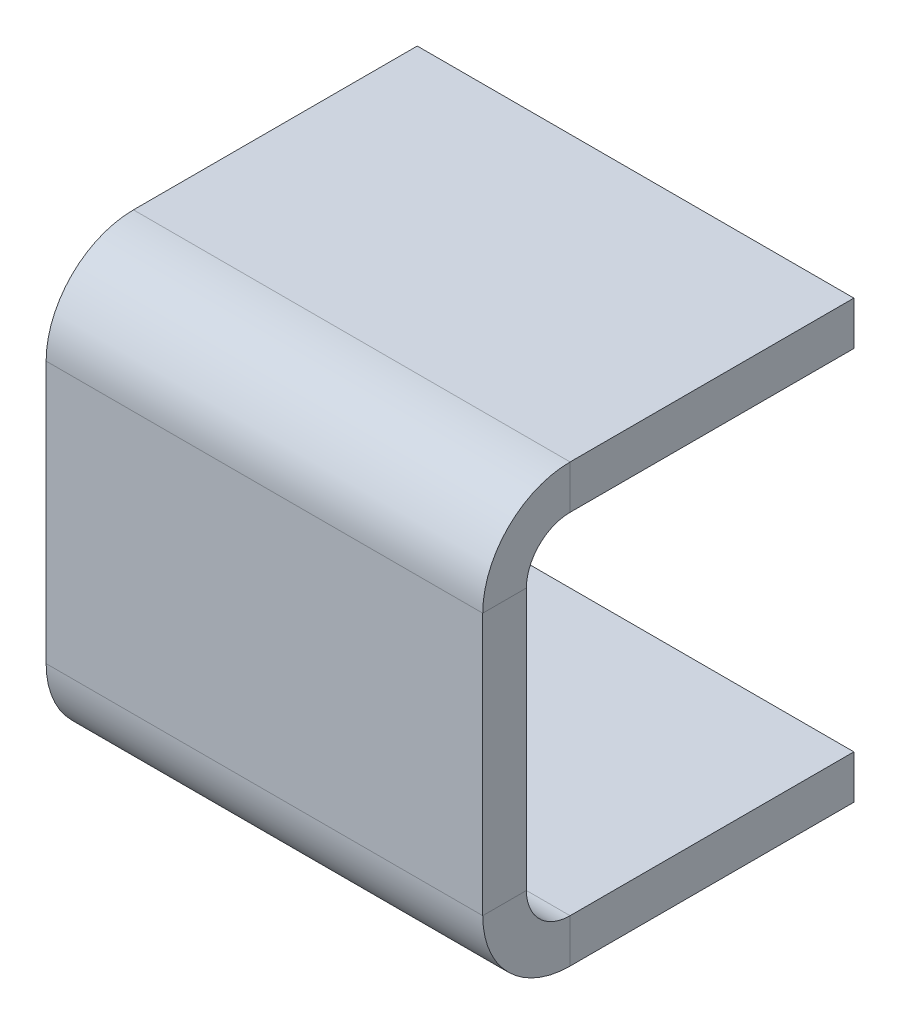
ISO-10303-21;
HEADER;
FILE_DESCRIPTION(('STEP AP214'),'2;1');
FILE_NAME('part.step','',(''),(''),'','','');
FILE_SCHEMA(('AUTOMOTIVE_DESIGN { 1 0 10303 214 1 1 1 1 }'));
ENDSEC;
DATA;
#1=APPLICATION_CONTEXT('core data for automotive mechanical design processes');
#2=APPLICATION_PROTOCOL_DEFINITION('international standard','automotive_design',2000,#1);
#3=PRODUCT_CONTEXT('',#1,'mechanical');
#4=PRODUCT('Part','Part','',(#3));
#5=PRODUCT_RELATED_PRODUCT_CATEGORY('part','',(#4));
#6=PRODUCT_DEFINITION_FORMATION('','',#4);
#7=PRODUCT_DEFINITION_CONTEXT('part definition',#1,'design');
#8=PRODUCT_DEFINITION('design','',#6,#7);
#9=PRODUCT_DEFINITION_SHAPE('','',#8);
#10=(LENGTH_UNIT() NAMED_UNIT(*) SI_UNIT(.MILLI.,.METRE.));
#11=(NAMED_UNIT(*) PLANE_ANGLE_UNIT() SI_UNIT($,.RADIAN.));
#12=(NAMED_UNIT(*) SI_UNIT($,.STERADIAN.) SOLID_ANGLE_UNIT());
#13=UNCERTAINTY_MEASURE_WITH_UNIT(LENGTH_MEASURE(1.E-05),#10,'distance_accuracy_value','');
#14=(GEOMETRIC_REPRESENTATION_CONTEXT(3) GLOBAL_UNCERTAINTY_ASSIGNED_CONTEXT((#13)) GLOBAL_UNIT_ASSIGNED_CONTEXT((#10,
#11,#12)) REPRESENTATION_CONTEXT('',''));
#15=CARTESIAN_POINT('',(0.,0.,0.));
#16=DIRECTION('',(0.,0.,1.));
#17=DIRECTION('',(1.,0.,0.));
#18=AXIS2_PLACEMENT_3D('',#15,#16,#17);
#19=CARTESIAN_POINT('',(0.,18.,17.));
#20=DIRECTION('',(-1.,0.,0.));
#21=DIRECTION('',(0.,-1.,0.));
#22=AXIS2_PLACEMENT_3D('',#19,#20,#21);
#23=PLANE('',#22);
#24=DIRECTION('',(0.,0.,1.));
#25=VECTOR('',#24,1.);
#26=CARTESIAN_POINT('',(0.,16.,15.));
#27=LINE('',#26,#25);
#28=CARTESIAN_POINT('',(0.,16.,15.));
#29=VERTEX_POINT('',#28);
#30=CARTESIAN_POINT('',(0.,16.,17.));
#31=VERTEX_POINT('',#30);
#32=EDGE_CURVE('E176',#29,#31,#27,.T.);
#33=ORIENTED_EDGE('',*,*,#32,.T.);
#34=DIRECTION('',(0.,1.,0.));
#35=VECTOR('',#34,1.);
#36=CARTESIAN_POINT('',(0.,18.,17.));
#37=LINE('',#36,#35);
#38=CARTESIAN_POINT('',(0.,3.99999999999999,17.));
#39=VERTEX_POINT('',#38);
#40=EDGE_CURVE('E197',#39,#31,#37,.T.);
#41=ORIENTED_EDGE('',*,*,#40,.F.);
#42=DIRECTION('',(0.,0.,1.));
#43=VECTOR('',#42,1.);
#44=CARTESIAN_POINT('',(0.,3.99999999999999,15.));
#45=LINE('',#44,#43);
#46=CARTESIAN_POINT('',(0.,3.99999999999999,15.));
#47=VERTEX_POINT('',#46);
#48=EDGE_CURVE('E184',#47,#39,#45,.T.);
#49=ORIENTED_EDGE('',*,*,#48,.F.);
#50=DIRECTION('',(0.,1.,0.));
#51=VECTOR('',#50,1.);
#52=CARTESIAN_POINT('',(0.,18.,15.));
#53=LINE('',#52,#51);
#54=EDGE_CURVE('E192',#47,#29,#53,.T.);
#55=ORIENTED_EDGE('',*,*,#54,.T.);
#56=EDGE_LOOP('',(#33,#41,#49,#55));
#57=FACE_BOUND('',#56,.T.);
#58=ADVANCED_FACE('F33',(#57),#23,.F.);
#59=CARTESIAN_POINT('',(-20.,2.,17.));
#60=DIRECTION('',(1.,0.,0.));
#61=DIRECTION('',(0.,0.,-1.));
#62=AXIS2_PLACEMENT_3D('',#59,#60,#61);
#63=PLANE('',#62);
#64=DIRECTION('',(0.,0.,1.));
#65=VECTOR('',#64,1.);
#66=CARTESIAN_POINT('',(-20.,16.,15.));
#67=LINE('',#66,#65);
#68=CARTESIAN_POINT('',(-20.,16.,15.));
#69=VERTEX_POINT('',#68);
#70=CARTESIAN_POINT('',(-20.,16.,17.));
#71=VERTEX_POINT('',#70);
#72=EDGE_CURVE('E178',#69,#71,#67,.T.);
#73=ORIENTED_EDGE('',*,*,#72,.F.);
#74=DIRECTION('',(0.,-1.,0.));
#75=VECTOR('',#74,1.);
#76=CARTESIAN_POINT('',(-20.,2.,15.));
#77=LINE('',#76,#75);
#78=CARTESIAN_POINT('',(-20.,3.99999999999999,15.));
#79=VERTEX_POINT('',#78);
#80=EDGE_CURVE('E195',#69,#79,#77,.T.);
#81=ORIENTED_EDGE('',*,*,#80,.T.);
#82=DIRECTION('',(0.,0.,1.));
#83=VECTOR('',#82,1.);
#84=CARTESIAN_POINT('',(-20.,3.99999999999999,15.));
#85=LINE('',#84,#83);
#86=CARTESIAN_POINT('',(-20.,3.99999999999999,17.));
#87=VERTEX_POINT('',#86);
#88=EDGE_CURVE('E180',#79,#87,#85,.T.);
#89=ORIENTED_EDGE('',*,*,#88,.T.);
#90=DIRECTION('',(0.,-1.,0.));
#91=VECTOR('',#90,1.);
#92=CARTESIAN_POINT('',(-20.,2.,17.));
#93=LINE('',#92,#91);
#94=EDGE_CURVE('E200',#71,#87,#93,.T.);
#95=ORIENTED_EDGE('',*,*,#94,.F.);
#96=EDGE_LOOP('',(#73,#81,#89,#95));
#97=FACE_BOUND('',#96,.T.);
#98=ADVANCED_FACE('F272',(#97),#63,.F.);
#99=CARTESIAN_POINT('',(0.,18.,17.));
#100=DIRECTION('',(0.,0.,1.));
#101=DIRECTION('',(1.,0.,0.));
#102=AXIS2_PLACEMENT_3D('',#99,#100,#101);
#103=PLANE('',#102);
#104=ORIENTED_EDGE('',*,*,#40,.T.);
#105=DIRECTION('',(1.,0.,0.));
#106=VECTOR('',#105,1.);
#107=CARTESIAN_POINT('',(0.,16.,17.));
#108=LINE('',#107,#106);
#109=EDGE_CURVE('E127',#31,#71,#108,.F.);
#110=ORIENTED_EDGE('',*,*,#109,.T.);
#111=ORIENTED_EDGE('',*,*,#94,.T.);
#112=DIRECTION('',(1.,0.,0.));
#113=VECTOR('',#112,1.);
#114=CARTESIAN_POINT('',(0.,3.99999999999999,17.));
#115=LINE('',#114,#113);
#116=EDGE_CURVE('E187',#87,#39,#115,.T.);
#117=ORIENTED_EDGE('',*,*,#116,.T.);
#118=EDGE_LOOP('',(#104,#110,#111,#117));
#119=FACE_BOUND('',#118,.T.);
#120=ADVANCED_FACE('F268',(#119),#103,.T.);
#121=CARTESIAN_POINT('',(0.,18.,15.));
#122=DIRECTION('',(0.,0.,1.));
#123=DIRECTION('',(1.,0.,0.));
#124=AXIS2_PLACEMENT_3D('',#121,#122,#123);
#125=PLANE('',#124);
#126=DIRECTION('',(1.,0.,0.));
#127=VECTOR('',#126,1.);
#128=CARTESIAN_POINT('',(0.,16.,15.));
#129=LINE('',#128,#127);
#130=EDGE_CURVE('E172',#29,#69,#129,.F.);
#131=ORIENTED_EDGE('',*,*,#130,.F.);
#132=ORIENTED_EDGE('',*,*,#54,.F.);
#133=DIRECTION('',(1.,0.,0.));
#134=VECTOR('',#133,1.);
#135=CARTESIAN_POINT('',(-20.,3.99999999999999,15.));
#136=LINE('',#135,#134);
#137=EDGE_CURVE('E182',#79,#47,#136,.T.);
#138=ORIENTED_EDGE('',*,*,#137,.F.);
#139=ORIENTED_EDGE('',*,*,#80,.F.);
#140=EDGE_LOOP('',(#131,#132,#138,#139));
#141=FACE_BOUND('',#140,.T.);
#142=ADVANCED_FACE('F262',(#141),#125,.F.);
#143=CARTESIAN_POINT('',(0.,2.,15.));
#144=DIRECTION('',(0.,-1.,0.));
#145=DIRECTION('',(1.,0.,0.));
#146=AXIS2_PLACEMENT_3D('',#143,#144,#145);
#147=PLANE('',#146);
#148=DIRECTION('',(1.,0.,0.));
#149=VECTOR('',#148,1.);
#150=CARTESIAN_POINT('',(0.,2.,13.));
#151=LINE('',#150,#149);
#152=CARTESIAN_POINT('',(0.,2.,13.));
#153=VERTEX_POINT('',#152);
#154=CARTESIAN_POINT('',(-20.,2.,13.));
#155=VERTEX_POINT('',#154);
#156=EDGE_CURVE('E207',#153,#155,#151,.F.);
#157=ORIENTED_EDGE('',*,*,#156,.F.);
#158=DIRECTION('',(0.,0.,-1.));
#159=VECTOR('',#158,1.);
#160=CARTESIAN_POINT('',(0.,2.,15.));
#161=LINE('',#160,#159);
#162=CARTESIAN_POINT('',(0.,2.,0.));
#163=VERTEX_POINT('',#162);
#164=EDGE_CURVE('E56',#153,#163,#161,.T.);
#165=ORIENTED_EDGE('',*,*,#164,.T.);
#166=DIRECTION('',(-1.,0.,0.));
#167=VECTOR('',#166,1.);
#168=CARTESIAN_POINT('',(0.,2.,0.));
#169=LINE('',#168,#167);
#170=CARTESIAN_POINT('',(-20.,2.,0.));
#171=VERTEX_POINT('',#170);
#172=EDGE_CURVE('E223',#163,#171,#169,.T.);
#173=ORIENTED_EDGE('',*,*,#172,.T.);
#174=DIRECTION('',(0.,0.,-1.));
#175=VECTOR('',#174,1.);
#176=CARTESIAN_POINT('',(-20.,2.,15.));
#177=LINE('',#176,#175);
#178=EDGE_CURVE('E11',#155,#171,#177,.T.);
#179=ORIENTED_EDGE('',*,*,#178,.F.);
#180=EDGE_LOOP('',(#157,#165,#173,#179));
#181=FACE_BOUND('',#180,.T.);
#182=ADVANCED_FACE('F35',(#181),#147,.F.);
#183=CARTESIAN_POINT('',(0.,0.,15.));
#184=DIRECTION('',(0.,-1.,0.));
#185=DIRECTION('',(1.,0.,0.));
#186=AXIS2_PLACEMENT_3D('',#183,#184,#185);
#187=PLANE('',#186);
#188=DIRECTION('',(0.,0.,-1.));
#189=VECTOR('',#188,1.);
#190=CARTESIAN_POINT('',(0.,0.,15.));
#191=LINE('',#190,#189);
#192=CARTESIAN_POINT('',(0.,0.,13.));
#193=VERTEX_POINT('',#192);
#194=CARTESIAN_POINT('',(0.,0.,0.));
#195=VERTEX_POINT('',#194);
#196=EDGE_CURVE('E237',#193,#195,#191,.T.);
#197=ORIENTED_EDGE('',*,*,#196,.F.);
#198=DIRECTION('',(1.,0.,0.));
#199=VECTOR('',#198,1.);
#200=CARTESIAN_POINT('',(0.,0.,13.));
#201=LINE('',#200,#199);
#202=CARTESIAN_POINT('',(-20.,0.,13.));
#203=VERTEX_POINT('',#202);
#204=EDGE_CURVE('E211',#193,#203,#201,.F.);
#205=ORIENTED_EDGE('',*,*,#204,.T.);
#206=DIRECTION('',(0.,0.,-1.));
#207=VECTOR('',#206,1.);
#208=CARTESIAN_POINT('',(-20.,0.,15.));
#209=LINE('',#208,#207);
#210=CARTESIAN_POINT('',(-20.,0.,0.));
#211=VERTEX_POINT('',#210);
#212=EDGE_CURVE('E41',#203,#211,#209,.T.);
#213=ORIENTED_EDGE('',*,*,#212,.T.);
#214=DIRECTION('',(-1.,0.,0.));
#215=VECTOR('',#214,1.);
#216=CARTESIAN_POINT('',(0.,0.,0.));
#217=LINE('',#216,#215);
#218=EDGE_CURVE('E230',#195,#211,#217,.T.);
#219=ORIENTED_EDGE('',*,*,#218,.F.);
#220=EDGE_LOOP('',(#197,#205,#213,#219));
#221=FACE_BOUND('',#220,.T.);
#222=ADVANCED_FACE('F243',(#221),#187,.T.);
#223=CARTESIAN_POINT('',(0.,2.,15.));
#224=DIRECTION('',(1.,0.,0.));
#225=DIRECTION('',(0.,1.,0.));
#226=AXIS2_PLACEMENT_3D('',#223,#224,#225);
#227=PLANE('',#226);
#228=ORIENTED_EDGE('',*,*,#164,.F.);
#229=DIRECTION('',(0.,-1.,0.));
#230=VECTOR('',#229,1.);
#231=CARTESIAN_POINT('',(0.,2.,13.));
#232=LINE('',#231,#230);
#233=EDGE_CURVE('E217',#153,#193,#232,.T.);
#234=ORIENTED_EDGE('',*,*,#233,.T.);
#235=ORIENTED_EDGE('',*,*,#196,.T.);
#236=DIRECTION('',(0.,-1.,0.));
#237=VECTOR('',#236,1.);
#238=CARTESIAN_POINT('',(0.,2.,0.));
#239=LINE('',#238,#237);
#240=EDGE_CURVE('E233',#163,#195,#239,.T.);
#241=ORIENTED_EDGE('',*,*,#240,.F.);
#242=EDGE_LOOP('',(#228,#234,#235,#241));
#243=FACE_BOUND('',#242,.T.);
#244=ADVANCED_FACE('F252',(#243),#227,.T.);
#245=CARTESIAN_POINT('',(-20.,0.,15.));
#246=DIRECTION('',(-1.,0.,0.));
#247=DIRECTION('',(0.,0.,1.));
#248=AXIS2_PLACEMENT_3D('',#245,#246,#247);
#249=PLANE('',#248);
#250=DIRECTION('',(0.,-1.,0.));
#251=VECTOR('',#250,1.);
#252=CARTESIAN_POINT('',(-20.,2.,13.));
#253=LINE('',#252,#251);
#254=EDGE_CURVE('E220',#155,#203,#253,.T.);
#255=ORIENTED_EDGE('',*,*,#254,.F.);
#256=ORIENTED_EDGE('',*,*,#178,.T.);
#257=DIRECTION('',(0.,1.,0.));
#258=VECTOR('',#257,1.);
#259=CARTESIAN_POINT('',(-20.,0.,0.));
#260=LINE('',#259,#258);
#261=EDGE_CURVE('E227',#211,#171,#260,.T.);
#262=ORIENTED_EDGE('',*,*,#261,.F.);
#263=ORIENTED_EDGE('',*,*,#212,.F.);
#264=EDGE_LOOP('',(#255,#256,#262,#263));
#265=FACE_BOUND('',#264,.T.);
#266=ADVANCED_FACE('F246',(#265),#249,.T.);
#267=CARTESIAN_POINT('',(0.,2.,0.));
#268=DIRECTION('',(0.,0.,1.));
#269=DIRECTION('',(1.,0.,0.));
#270=AXIS2_PLACEMENT_3D('',#267,#268,#269);
#271=PLANE('',#270);
#272=ORIENTED_EDGE('',*,*,#172,.F.);
#273=ORIENTED_EDGE('',*,*,#240,.T.);
#274=ORIENTED_EDGE('',*,*,#218,.T.);
#275=ORIENTED_EDGE('',*,*,#261,.T.);
#276=EDGE_LOOP('',(#272,#273,#274,#275));
#277=FACE_BOUND('',#276,.T.);
#278=ADVANCED_FACE('F249',(#277),#271,.F.);
#279=CARTESIAN_POINT('',(-20.,3.99999999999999,13.));
#280=DIRECTION('',(-1.,0.,0.));
#281=DIRECTION('',(0.,0.,1.));
#282=AXIS2_PLACEMENT_3D('',#279,#280,#281);
#283=PLANE('',#282);
#284=ORIENTED_EDGE('',*,*,#88,.F.);
#285=CARTESIAN_POINT('',(-20.,3.99999999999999,13.));
#286=DIRECTION('',(1.,0.,0.));
#287=DIRECTION('',(0.,0.,-1.));
#288=AXIS2_PLACEMENT_3D('',#285,#286,#287);
#289=CIRCLE('',#288,2.);
#290=EDGE_CURVE('E203',#155,#79,#289,.F.);
#291=ORIENTED_EDGE('',*,*,#290,.F.);
#292=ORIENTED_EDGE('',*,*,#254,.T.);
#293=CARTESIAN_POINT('',(-20.,3.99999999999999,13.));
#294=DIRECTION('',(1.,0.,0.));
#295=DIRECTION('',(0.,0.,-1.));
#296=AXIS2_PLACEMENT_3D('',#293,#294,#295);
#297=CIRCLE('',#296,4.);
#298=EDGE_CURVE('E214',#203,#87,#297,.F.);
#299=ORIENTED_EDGE('',*,*,#298,.T.);
#300=EDGE_LOOP('',(#284,#291,#292,#299));
#301=FACE_BOUND('',#300,.T.);
#302=ADVANCED_FACE('F289',(#301),#283,.T.);
#303=CARTESIAN_POINT('',(0.,3.99999999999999,13.));
#304=DIRECTION('',(-1.,0.,0.));
#305=DIRECTION('',(0.,0.,1.));
#306=AXIS2_PLACEMENT_3D('',#303,#304,#305);
#307=PLANE('',#306);
#308=CARTESIAN_POINT('',(0.,3.99999999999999,13.));
#309=DIRECTION('',(1.,0.,0.));
#310=DIRECTION('',(0.,0.,-1.));
#311=AXIS2_PLACEMENT_3D('',#308,#309,#310);
#312=CIRCLE('',#311,2.);
#313=EDGE_CURVE('E202',#47,#153,#312,.T.);
#314=ORIENTED_EDGE('',*,*,#313,.F.);
#315=ORIENTED_EDGE('',*,*,#48,.T.);
#316=CARTESIAN_POINT('',(0.,3.99999999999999,13.));
#317=DIRECTION('',(1.,0.,0.));
#318=DIRECTION('',(0.,0.,-1.));
#319=AXIS2_PLACEMENT_3D('',#316,#317,#318);
#320=CIRCLE('',#319,4.);
#321=EDGE_CURVE('E206',#39,#193,#320,.T.);
#322=ORIENTED_EDGE('',*,*,#321,.T.);
#323=ORIENTED_EDGE('',*,*,#233,.F.);
#324=EDGE_LOOP('',(#314,#315,#322,#323));
#325=FACE_BOUND('',#324,.T.);
#326=ADVANCED_FACE('F255',(#325),#307,.F.);
#327=CARTESIAN_POINT('',(0.,3.99999999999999,13.));
#328=DIRECTION('',(1.,0.,0.));
#329=DIRECTION('',(0.,0.,1.));
#330=AXIS2_PLACEMENT_3D('',#327,#328,#329);
#331=CYLINDRICAL_SURFACE('',#330,4.);
#332=ORIENTED_EDGE('',*,*,#204,.F.);
#333=ORIENTED_EDGE('',*,*,#321,.F.);
#334=ORIENTED_EDGE('',*,*,#116,.F.);
#335=ORIENTED_EDGE('',*,*,#298,.F.);
#336=EDGE_LOOP('',(#332,#333,#334,#335));
#337=FACE_BOUND('',#336,.T.);
#338=ADVANCED_FACE('F285',(#337),#331,.T.);
#339=CARTESIAN_POINT('',(0.,3.99999999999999,13.));
#340=DIRECTION('',(1.,0.,0.));
#341=DIRECTION('',(0.,0.,1.));
#342=AXIS2_PLACEMENT_3D('',#339,#340,#341);
#343=CYLINDRICAL_SURFACE('',#342,2.);
#344=ORIENTED_EDGE('',*,*,#156,.T.);
#345=ORIENTED_EDGE('',*,*,#290,.T.);
#346=ORIENTED_EDGE('',*,*,#137,.T.);
#347=ORIENTED_EDGE('',*,*,#313,.T.);
#348=EDGE_LOOP('',(#344,#345,#346,#347));
#349=FACE_BOUND('',#348,.T.);
#350=ADVANCED_FACE('F258',(#349),#343,.F.);
#351=CARTESIAN_POINT('',(-20.,16.,13.));
#352=DIRECTION('',(-1.,0.,0.));
#353=DIRECTION('',(0.,0.,1.));
#354=AXIS2_PLACEMENT_3D('',#351,#352,#353);
#355=PLANE('',#354);
#356=DIRECTION('',(0.,1.,0.));
#357=VECTOR('',#356,1.);
#358=CARTESIAN_POINT('',(-20.,18.,13.));
#359=LINE('',#358,#357);
#360=CARTESIAN_POINT('',(-20.,18.,13.));
#361=VERTEX_POINT('',#360);
#362=CARTESIAN_POINT('',(-20.,20.,13.));
#363=VERTEX_POINT('',#362);
#364=EDGE_CURVE('E511',#361,#363,#359,.T.);
#365=ORIENTED_EDGE('',*,*,#364,.F.);
#366=CARTESIAN_POINT('',(-20.,16.,13.));
#367=DIRECTION('',(1.,0.,0.));
#368=DIRECTION('',(0.,0.,-1.));
#369=AXIS2_PLACEMENT_3D('',#366,#367,#368);
#370=CIRCLE('',#369,2.);
#371=EDGE_CURVE('E130',#69,#361,#370,.F.);
#372=ORIENTED_EDGE('',*,*,#371,.F.);
#373=ORIENTED_EDGE('',*,*,#72,.T.);
#374=CARTESIAN_POINT('',(-20.,16.,13.));
#375=DIRECTION('',(1.,0.,0.));
#376=DIRECTION('',(0.,0.,-1.));
#377=AXIS2_PLACEMENT_3D('',#374,#375,#376);
#378=CIRCLE('',#377,4.);
#379=EDGE_CURVE('E48',#71,#363,#378,.F.);
#380=ORIENTED_EDGE('',*,*,#379,.T.);
#381=EDGE_LOOP('',(#365,#372,#373,#380));
#382=FACE_BOUND('',#381,.T.);
#383=ADVANCED_FACE('F284',(#382),#355,.T.);
#384=CARTESIAN_POINT('',(0.,16.,13.));
#385=DIRECTION('',(-1.,0.,0.));
#386=DIRECTION('',(0.,0.,1.));
#387=AXIS2_PLACEMENT_3D('',#384,#385,#386);
#388=PLANE('',#387);
#389=CARTESIAN_POINT('',(0.,16.,13.));
#390=DIRECTION('',(1.,0.,0.));
#391=DIRECTION('',(0.,0.,-1.));
#392=AXIS2_PLACEMENT_3D('',#389,#390,#391);
#393=CIRCLE('',#392,2.);
#394=CARTESIAN_POINT('',(0.,18.,13.));
#395=VERTEX_POINT('',#394);
#396=EDGE_CURVE('E137',#395,#29,#393,.T.);
#397=ORIENTED_EDGE('',*,*,#396,.F.);
#398=DIRECTION('',(0.,1.,0.));
#399=VECTOR('',#398,1.);
#400=CARTESIAN_POINT('',(0.,18.,13.));
#401=LINE('',#400,#399);
#402=CARTESIAN_POINT('',(0.,20.,13.));
#403=VERTEX_POINT('',#402);
#404=EDGE_CURVE('E134',#395,#403,#401,.T.);
#405=ORIENTED_EDGE('',*,*,#404,.T.);
#406=CARTESIAN_POINT('',(0.,16.,13.));
#407=DIRECTION('',(1.,0.,0.));
#408=DIRECTION('',(0.,0.,-1.));
#409=AXIS2_PLACEMENT_3D('',#406,#407,#408);
#410=CIRCLE('',#409,4.);
#411=EDGE_CURVE('E121',#403,#31,#410,.T.);
#412=ORIENTED_EDGE('',*,*,#411,.T.);
#413=ORIENTED_EDGE('',*,*,#32,.F.);
#414=EDGE_LOOP('',(#397,#405,#412,#413));
#415=FACE_BOUND('',#414,.T.);
#416=ADVANCED_FACE('F135',(#415),#388,.F.);
#417=CARTESIAN_POINT('',(0.,16.,13.));
#418=DIRECTION('',(1.,0.,0.));
#419=DIRECTION('',(0.,1.,0.));
#420=AXIS2_PLACEMENT_3D('',#417,#418,#419);
#421=CYLINDRICAL_SURFACE('',#420,4.);
#422=ORIENTED_EDGE('',*,*,#109,.F.);
#423=ORIENTED_EDGE('',*,*,#411,.F.);
#424=DIRECTION('',(-1.,0.,0.));
#425=VECTOR('',#424,1.);
#426=CARTESIAN_POINT('',(-20.,20.,13.));
#427=LINE('',#426,#425);
#428=EDGE_CURVE('E125',#403,#363,#427,.T.);
#429=ORIENTED_EDGE('',*,*,#428,.T.);
#430=ORIENTED_EDGE('',*,*,#379,.F.);
#431=EDGE_LOOP('',(#422,#423,#429,#430));
#432=FACE_BOUND('',#431,.T.);
#433=ADVANCED_FACE('F123',(#432),#421,.T.);
#434=CARTESIAN_POINT('',(0.,16.,13.));
#435=DIRECTION('',(1.,0.,0.));
#436=DIRECTION('',(0.,1.,0.));
#437=AXIS2_PLACEMENT_3D('',#434,#435,#436);
#438=CYLINDRICAL_SURFACE('',#437,2.);
#439=ORIENTED_EDGE('',*,*,#130,.T.);
#440=ORIENTED_EDGE('',*,*,#371,.T.);
#441=DIRECTION('',(1.,0.,0.));
#442=VECTOR('',#441,1.);
#443=CARTESIAN_POINT('',(-20.,18.,13.));
#444=LINE('',#443,#442);
#445=EDGE_CURVE('E141',#361,#395,#444,.T.);
#446=ORIENTED_EDGE('',*,*,#445,.T.);
#447=ORIENTED_EDGE('',*,*,#396,.T.);
#448=EDGE_LOOP('',(#439,#440,#446,#447));
#449=FACE_BOUND('',#448,.T.);
#450=ADVANCED_FACE('F338',(#449),#438,.F.);
#451=CARTESIAN_POINT('',(0.,20.0000000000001,0.));
#452=DIRECTION('',(-1.,0.,0.));
#453=DIRECTION('',(0.,0.,1.));
#454=AXIS2_PLACEMENT_3D('',#451,#452,#453);
#455=PLANE('',#454);
#456=ORIENTED_EDGE('',*,*,#404,.F.);
#457=DIRECTION('',(0.,0.,-1.));
#458=VECTOR('',#457,1.);
#459=CARTESIAN_POINT('',(0.,18.0000000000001,0.));
#460=LINE('',#459,#458);
#461=CARTESIAN_POINT('',(0.,18.0000000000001,0.));
#462=VERTEX_POINT('',#461);
#463=EDGE_CURVE('E150',#395,#462,#460,.T.);
#464=ORIENTED_EDGE('',*,*,#463,.T.);
#465=DIRECTION('',(0.,-1.,0.));
#466=VECTOR('',#465,1.);
#467=CARTESIAN_POINT('',(0.,20.0000000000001,0.));
#468=LINE('',#467,#466);
#469=CARTESIAN_POINT('',(0.,20.0000000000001,0.));
#470=VERTEX_POINT('',#469);
#471=EDGE_CURVE('E154',#470,#462,#468,.T.);
#472=ORIENTED_EDGE('',*,*,#471,.F.);
#473=DIRECTION('',(0.,0.,-1.));
#474=VECTOR('',#473,1.);
#475=CARTESIAN_POINT('',(0.,20.0000000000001,0.));
#476=LINE('',#475,#474);
#477=EDGE_CURVE('E146',#403,#470,#476,.T.);
#478=ORIENTED_EDGE('',*,*,#477,.F.);
#479=EDGE_LOOP('',(#456,#464,#472,#478));
#480=FACE_BOUND('',#479,.T.);
#481=ADVANCED_FACE('F152',(#480),#455,.F.);
#482=CARTESIAN_POINT('',(-20.,20.,15.));
#483=DIRECTION('',(1.,0.,0.));
#484=DIRECTION('',(0.,0.,-1.));
#485=AXIS2_PLACEMENT_3D('',#482,#483,#484);
#486=PLANE('',#485);
#487=ORIENTED_EDGE('',*,*,#364,.T.);
#488=DIRECTION('',(0.,0.,1.));
#489=VECTOR('',#488,1.);
#490=CARTESIAN_POINT('',(-20.,20.,15.));
#491=LINE('',#490,#489);
#492=CARTESIAN_POINT('',(-20.,20.0000000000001,0.));
#493=VERTEX_POINT('',#492);
#494=EDGE_CURVE('E149',#493,#363,#491,.T.);
#495=ORIENTED_EDGE('',*,*,#494,.F.);
#496=DIRECTION('',(0.,-1.,0.));
#497=VECTOR('',#496,1.);
#498=CARTESIAN_POINT('',(-20.,20.0000000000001,0.));
#499=LINE('',#498,#497);
#500=CARTESIAN_POINT('',(-20.,18.0000000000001,0.));
#501=VERTEX_POINT('',#500);
#502=EDGE_CURVE('E166',#493,#501,#499,.T.);
#503=ORIENTED_EDGE('',*,*,#502,.T.);
#504=DIRECTION('',(0.,0.,1.));
#505=VECTOR('',#504,1.);
#506=CARTESIAN_POINT('',(-20.,18.,15.));
#507=LINE('',#506,#505);
#508=EDGE_CURVE('E157',#501,#361,#507,.T.);
#509=ORIENTED_EDGE('',*,*,#508,.T.);
#510=EDGE_LOOP('',(#487,#495,#503,#509));
#511=FACE_BOUND('',#510,.T.);
#512=ADVANCED_FACE('F357',(#511),#486,.F.);
#513=CARTESIAN_POINT('',(-20.,20.,15.));
#514=DIRECTION('',(0.,-1.,0.));
#515=DIRECTION('',(0.,0.,-1.));
#516=AXIS2_PLACEMENT_3D('',#513,#514,#515);
#517=PLANE('',#516);
#518=ORIENTED_EDGE('',*,*,#428,.F.);
#519=ORIENTED_EDGE('',*,*,#477,.T.);
#520=DIRECTION('',(-1.,0.,0.));
#521=VECTOR('',#520,1.);
#522=CARTESIAN_POINT('',(-20.,20.0000000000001,0.));
#523=LINE('',#522,#521);
#524=EDGE_CURVE('E156',#470,#493,#523,.T.);
#525=ORIENTED_EDGE('',*,*,#524,.T.);
#526=ORIENTED_EDGE('',*,*,#494,.T.);
#527=EDGE_LOOP('',(#518,#519,#525,#526));
#528=FACE_BOUND('',#527,.T.);
#529=ADVANCED_FACE('F145',(#528),#517,.F.);
#530=CARTESIAN_POINT('',(-20.,18.,15.));
#531=DIRECTION('',(0.,-1.,0.));
#532=DIRECTION('',(0.,0.,-1.));
#533=AXIS2_PLACEMENT_3D('',#530,#531,#532);
#534=PLANE('',#533);
#535=ORIENTED_EDGE('',*,*,#463,.F.);
#536=ORIENTED_EDGE('',*,*,#445,.F.);
#537=ORIENTED_EDGE('',*,*,#508,.F.);
#538=DIRECTION('',(-1.,0.,0.));
#539=VECTOR('',#538,1.);
#540=CARTESIAN_POINT('',(-20.,18.0000000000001,0.));
#541=LINE('',#540,#539);
#542=EDGE_CURVE('E161',#462,#501,#541,.T.);
#543=ORIENTED_EDGE('',*,*,#542,.F.);
#544=EDGE_LOOP('',(#535,#536,#537,#543));
#545=FACE_BOUND('',#544,.T.);
#546=ADVANCED_FACE('F371',(#545),#534,.T.);
#547=CARTESIAN_POINT('',(-20.,20.0000000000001,0.));
#548=DIRECTION('',(0.,0.,1.));
#549=DIRECTION('',(0.,-1.,0.));
#550=AXIS2_PLACEMENT_3D('',#547,#548,#549);
#551=PLANE('',#550);
#552=ORIENTED_EDGE('',*,*,#542,.T.);
#553=ORIENTED_EDGE('',*,*,#502,.F.);
#554=ORIENTED_EDGE('',*,*,#524,.F.);
#555=ORIENTED_EDGE('',*,*,#471,.T.);
#556=EDGE_LOOP('',(#552,#553,#554,#555));
#557=FACE_BOUND('',#556,.T.);
#558=ADVANCED_FACE('F378',(#557),#551,.F.);
#559=CLOSED_SHELL('',(#58,#98,#120,#142,#182,#222,#244,#266,#278,#302,#326,#338,#350,#383,#416,
#433,#450,#481,#512,#529,#546,#558));
#560=MANIFOLD_SOLID_BREP('B2',#559);
#561=ADVANCED_BREP_SHAPE_REPRESENTATION('',(#18,#560),#14);
#562=SHAPE_DEFINITION_REPRESENTATION(#9,#561);
ENDSEC;
END-ISO-10303-21;
